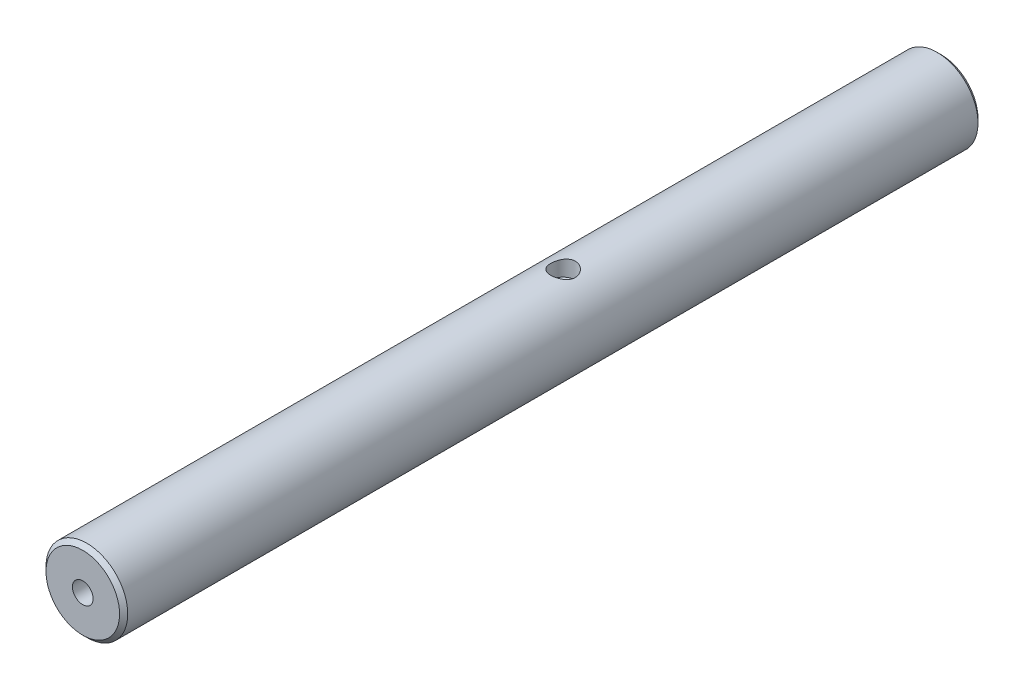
ISO-10303-21;
HEADER;
FILE_DESCRIPTION(('STEP AP214'),'2;1');
FILE_NAME('part.step','',(''),(''),'','','');
FILE_SCHEMA(('AUTOMOTIVE_DESIGN { 1 0 10303 214 1 1 1 1 }'));
ENDSEC;
DATA;
#1=APPLICATION_CONTEXT('core data for automotive mechanical design processes');
#2=APPLICATION_PROTOCOL_DEFINITION('international standard','automotive_design',2000,#1);
#3=PRODUCT_CONTEXT('',#1,'mechanical');
#4=PRODUCT('Part','Part','',(#3));
#5=PRODUCT_RELATED_PRODUCT_CATEGORY('part','',(#4));
#6=PRODUCT_DEFINITION_FORMATION('','',#4);
#7=PRODUCT_DEFINITION_CONTEXT('part definition',#1,'design');
#8=PRODUCT_DEFINITION('design','',#6,#7);
#9=PRODUCT_DEFINITION_SHAPE('','',#8);
#10=(LENGTH_UNIT() NAMED_UNIT(*) SI_UNIT(.MILLI.,.METRE.));
#11=(NAMED_UNIT(*) PLANE_ANGLE_UNIT() SI_UNIT($,.RADIAN.));
#12=(NAMED_UNIT(*) SI_UNIT($,.STERADIAN.) SOLID_ANGLE_UNIT());
#13=UNCERTAINTY_MEASURE_WITH_UNIT(LENGTH_MEASURE(1.E-05),#10,'distance_accuracy_value','');
#14=(GEOMETRIC_REPRESENTATION_CONTEXT(3) GLOBAL_UNCERTAINTY_ASSIGNED_CONTEXT((#13)) GLOBAL_UNIT_ASSIGNED_CONTEXT((#10,
#11,#12)) REPRESENTATION_CONTEXT('',''));
#15=CARTESIAN_POINT('',(0.,0.,0.));
#16=DIRECTION('',(0.,0.,1.));
#17=DIRECTION('',(1.,0.,0.));
#18=AXIS2_PLACEMENT_3D('',#15,#16,#17);
#19=CARTESIAN_POINT('',(0.,0.,380.));
#20=DIRECTION('',(0.,0.,1.));
#21=DIRECTION('',(1.,0.,0.));
#22=AXIS2_PLACEMENT_3D('',#19,#20,#21);
#23=CONICAL_SURFACE('',#22,5.05300000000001,1.02974425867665);
#24=CARTESIAN_POINT('',(0.,0.,380.));
#25=DIRECTION('',(0.,0.,1.));
#26=DIRECTION('',(1.,0.,0.));
#27=AXIS2_PLACEMENT_3D('',#24,#25,#26);
#28=CIRCLE('',#27,5.053);
#29=CARTESIAN_POINT('',(5.053,0.,380.));
#30=VERTEX_POINT('',#29);
#31=EDGE_CURVE('E75',#30,#30,#28,.T.);
#32=ORIENTED_EDGE('',*,*,#31,.T.);
#33=EDGE_LOOP('',(#32));
#34=FACE_BOUND('',#33,.T.);
#35=CARTESIAN_POINT('',(0.,0.,376.963851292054));
#36=VERTEX_POINT('',#35);
#37=VERTEX_LOOP('',#36);
#38=FACE_BOUND('',#37,.T.);
#39=ADVANCED_FACE('F16',(#34,#38),#23,.F.);
#40=CARTESIAN_POINT('',(0.,12.,185.));
#41=DIRECTION('',(0.,1.,0.));
#42=DIRECTION('',(0.,0.,1.));
#43=AXIS2_PLACEMENT_3D('',#40,#41,#42);
#44=CONICAL_SURFACE('',#43,6.,1.02974425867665);
#45=CARTESIAN_POINT('',(0.,12.,185.));
#46=DIRECTION('',(0.,1.,0.));
#47=DIRECTION('',(0.,0.,1.));
#48=AXIS2_PLACEMENT_3D('',#45,#46,#47);
#49=CIRCLE('',#48,6.);
#50=CARTESIAN_POINT('',(0.,12.,191.));
#51=VERTEX_POINT('',#50);
#52=EDGE_CURVE('E71',#51,#51,#49,.T.);
#53=ORIENTED_EDGE('',*,*,#52,.T.);
#54=EDGE_LOOP('',(#53));
#55=FACE_BOUND('',#54,.T.);
#56=CARTESIAN_POINT('',(0.,8.39483628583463,185.));
#57=VERTEX_POINT('',#56);
#58=VERTEX_LOOP('',#57);
#59=FACE_BOUND('',#58,.T.);
#60=ADVANCED_FACE('F34',(#55,#59),#44,.F.);
#61=CARTESIAN_POINT('',(0.,0.,420.));
#62=DIRECTION('',(0.,0.,-1.));
#63=DIRECTION('',(0.,1.,0.));
#64=AXIS2_PLACEMENT_3D('',#61,#62,#63);
#65=CYLINDRICAL_SURFACE('',#64,5.053);
#66=ORIENTED_EDGE('',*,*,#31,.F.);
#67=EDGE_LOOP('',(#66));
#68=FACE_BOUND('',#67,.T.);
#69=CARTESIAN_POINT('',(0.,0.,420.));
#70=DIRECTION('',(0.,0.,-1.));
#71=DIRECTION('',(0.,1.,0.));
#72=AXIS2_PLACEMENT_3D('',#69,#70,#71);
#73=CIRCLE('',#72,5.053);
#74=CARTESIAN_POINT('',(0.,5.053,420.));
#75=VERTEX_POINT('',#74);
#76=EDGE_CURVE('E21',#75,#75,#73,.F.);
#77=ORIENTED_EDGE('',*,*,#76,.T.);
#78=EDGE_LOOP('',(#77));
#79=FACE_BOUND('',#78,.T.);
#80=ADVANCED_FACE('F40',(#68,#79),#65,.F.);
#81=CARTESIAN_POINT('',(0.,0.,0.));
#82=DIRECTION('',(0.,0.,-1.));
#83=DIRECTION('',(-1.,0.,0.));
#84=AXIS2_PLACEMENT_3D('',#81,#82,#83);
#85=PLANE('',#84);
#86=CARTESIAN_POINT('',(0.,0.,-8.97448781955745E-10));
#87=DIRECTION('',(0.,0.,1.));
#88=DIRECTION('',(1.,0.,0.));
#89=AXIS2_PLACEMENT_3D('',#86,#87,#88);
#90=CIRCLE('',#89,18.0000000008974);
#91=CARTESIAN_POINT('',(18.0000000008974,0.,-8.97448781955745E-10));
#92=VERTEX_POINT('',#91);
#93=EDGE_CURVE('E65',#92,#92,#90,.T.);
#94=ORIENTED_EDGE('',*,*,#93,.F.);
#95=EDGE_LOOP('',(#94));
#96=FACE_BOUND('',#95,.T.);
#97=ADVANCED_FACE('F91',(#96),#85,.T.);
#98=CARTESIAN_POINT('',(0.,20.0028866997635,185.));
#99=DIRECTION('',(0.,-1.,0.));
#100=DIRECTION('',(0.,0.,-1.));
#101=AXIS2_PLACEMENT_3D('',#98,#99,#100);
#102=CYLINDRICAL_SURFACE('',#101,6.);
#103=ORIENTED_EDGE('',*,*,#52,.F.);
#104=EDGE_LOOP('',(#103));
#105=FACE_BOUND('',#104,.T.);
#106=CARTESIAN_POINT('',(6.,19.0787840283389,185.));
#107=CARTESIAN_POINT('',(6.00000311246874,19.0787815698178,185.164358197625));
#108=CARTESIAN_POINT('',(5.99324384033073,19.0809122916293,185.328679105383));
#109=CARTESIAN_POINT('',(5.96627542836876,19.0893627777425,185.656155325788));
#110=CARTESIAN_POINT('',(5.94606367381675,19.095683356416,185.819310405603));
#111=CARTESIAN_POINT('',(5.89235350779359,19.1123246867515,186.14330994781));
#112=CARTESIAN_POINT('',(5.85884674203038,19.1226479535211,186.304152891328));
#113=CARTESIAN_POINT('',(5.77883325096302,19.1469797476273,186.622347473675));
#114=CARTESIAN_POINT('',(5.73232159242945,19.1609896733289,186.779697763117));
#115=CARTESIAN_POINT('',(5.62681244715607,19.1922380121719,187.089420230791));
#116=CARTESIAN_POINT('',(5.56784405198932,19.2094688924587,187.241803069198));
#117=CARTESIAN_POINT('',(5.43782627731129,19.2466778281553,187.541001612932));
#118=CARTESIAN_POINT('',(5.36677235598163,19.2666569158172,187.687815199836));
#119=CARTESIAN_POINT('',(5.13631085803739,19.3298668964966,188.118348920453));
#120=CARTESIAN_POINT('',(4.95949232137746,19.376405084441,188.392486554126));
#121=CARTESIAN_POINT('',(4.55855210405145,19.4746805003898,188.915517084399));
#122=CARTESIAN_POINT('',(4.3332205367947,19.5265284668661,189.163461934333));
#123=CARTESIAN_POINT('',(3.96675985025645,19.6030731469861,189.504753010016));
#124=CARTESIAN_POINT('',(3.83976545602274,19.6284004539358,189.613476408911));
#125=CARTESIAN_POINT('',(3.57703626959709,19.6779737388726,189.820030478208));
#126=CARTESIAN_POINT('',(3.44130477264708,19.7022201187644,189.917865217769));
#127=CARTESIAN_POINT('',(3.15893048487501,19.7494833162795,190.103956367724));
#128=CARTESIAN_POINT('',(3.0121157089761,19.7724624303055,190.191961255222));
#129=CARTESIAN_POINT('',(2.71127488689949,19.8159550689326,190.355208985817));
#130=CARTESIAN_POINT('',(2.5572516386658,19.8364695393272,190.430456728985));
#131=CARTESIAN_POINT('',(2.24313420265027,19.8744394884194,190.567556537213));
#132=CARTESIAN_POINT('',(2.08304511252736,19.8918974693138,190.629419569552));
#133=CARTESIAN_POINT('',(1.75789816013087,19.9232649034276,190.739272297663));
#134=CARTESIAN_POINT('',(1.59284154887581,19.9371752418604,190.787265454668));
#135=CARTESIAN_POINT('',(1.19319873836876,19.9657351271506,190.88503186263));
#136=CARTESIAN_POINT('',(0.956797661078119,19.9785237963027,190.928081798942));
#137=CARTESIAN_POINT('',(0.48023785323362,19.995654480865,190.985562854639));
#138=CARTESIAN_POINT('',(0.240079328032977,19.9999969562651,190.999995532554));
#139=CARTESIAN_POINT('',(-0.164545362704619,20.0000020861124,191.000003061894));
#140=CARTESIAN_POINT('',(-0.329053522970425,19.9979657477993,190.993228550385));
#141=CARTESIAN_POINT('',(-0.656909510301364,19.9898808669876,190.966197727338));
#142=CARTESIAN_POINT('',(-0.820257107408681,19.983831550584,190.945938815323));
#143=CARTESIAN_POINT('',(-1.14464625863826,19.9678787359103,190.892099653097));
#144=CARTESIAN_POINT('',(-1.305686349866,19.9579728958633,190.858511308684));
#145=CARTESIAN_POINT('',(-1.62427996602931,19.9345739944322,190.778296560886));
#146=CARTESIAN_POINT('',(-1.78183215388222,19.921079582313,190.731665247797));
#147=CARTESIAN_POINT('',(-2.09198432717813,19.8908978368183,190.625867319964));
#148=CARTESIAN_POINT('',(-2.24459410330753,19.8742173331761,190.566727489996));
#149=CARTESIAN_POINT('',(-2.54422846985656,19.838087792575,190.436325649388));
#150=CARTESIAN_POINT('',(-2.69125093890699,19.81863771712,190.36505908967));
#151=CARTESIAN_POINT('',(-3.12235749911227,19.7568940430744,190.133909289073));
#152=CARTESIAN_POINT('',(-3.39681281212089,19.7111730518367,189.956561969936));
#153=CARTESIAN_POINT('',(-3.91953855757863,19.6140231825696,189.555066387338));
#154=CARTESIAN_POINT('',(-4.16694953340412,19.5624773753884,189.329827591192));
#155=CARTESIAN_POINT('',(-4.5074562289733,19.485801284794,188.963677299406));
#156=CARTESIAN_POINT('',(-4.61592229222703,19.4603320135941,188.836812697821));
#157=CARTESIAN_POINT('',(-4.82197820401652,19.4103000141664,188.574397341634));
#158=CARTESIAN_POINT('',(-4.91957207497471,19.3857369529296,188.438849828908));
#159=CARTESIAN_POINT('',(-5.10537240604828,19.3376473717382,188.156641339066));
#160=CARTESIAN_POINT('',(-5.19330666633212,19.3141584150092,188.009794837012));
#161=CARTESIAN_POINT('',(-5.35641042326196,19.2695618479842,187.708899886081));
#162=CARTESIAN_POINT('',(-5.43158482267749,19.2484533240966,187.554854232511));
#163=CARTESIAN_POINT('',(-5.56853860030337,19.2092804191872,187.240694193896));
#164=CARTESIAN_POINT('',(-5.63032930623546,19.1912134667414,187.08058507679));
#165=CARTESIAN_POINT('',(-5.74004058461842,19.1586846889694,186.755387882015));
#166=CARTESIAN_POINT('',(-5.78796468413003,19.1442219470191,186.59030108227));
#167=CARTESIAN_POINT('',(-5.88544736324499,19.1145256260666,186.191052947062));
#168=CARTESIAN_POINT('',(-5.92834031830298,19.1011952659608,185.955085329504));
#169=CARTESIAN_POINT('',(-5.98561344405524,19.0833265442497,185.479385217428));
#170=CARTESIAN_POINT('',(-5.99999546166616,19.0787876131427,185.239652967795));
#171=CARTESIAN_POINT('',(-6.00000311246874,19.0787815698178,184.835641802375));
#172=CARTESIAN_POINT('',(-5.99324384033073,19.0809122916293,184.671320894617));
#173=CARTESIAN_POINT('',(-5.96627542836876,19.0893627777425,184.343844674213));
#174=CARTESIAN_POINT('',(-5.94606367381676,19.095683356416,184.180689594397));
#175=CARTESIAN_POINT('',(-5.89235350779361,19.1123246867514,183.85669005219));
#176=CARTESIAN_POINT('',(-5.85884674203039,19.1226479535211,183.695847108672));
#177=CARTESIAN_POINT('',(-5.77883325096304,19.1469797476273,183.377652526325));
#178=CARTESIAN_POINT('',(-5.73232159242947,19.1609896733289,183.220302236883));
#179=CARTESIAN_POINT('',(-5.62681244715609,19.1922380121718,182.91057976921));
#180=CARTESIAN_POINT('',(-5.56784405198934,19.2094688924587,182.758196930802));
#181=CARTESIAN_POINT('',(-5.43782627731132,19.2466778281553,182.458998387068));
#182=CARTESIAN_POINT('',(-5.36677235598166,19.2666569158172,182.312184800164));
#183=CARTESIAN_POINT('',(-5.13631085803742,19.3298668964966,181.881651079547));
#184=CARTESIAN_POINT('',(-4.95949232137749,19.376405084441,181.607513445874));
#185=CARTESIAN_POINT('',(-4.5585521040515,19.4746805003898,181.084482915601));
#186=CARTESIAN_POINT('',(-4.33322053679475,19.5265284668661,180.836538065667));
#187=CARTESIAN_POINT('',(-3.96675985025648,19.6030731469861,180.495246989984));
#188=CARTESIAN_POINT('',(-3.83976545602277,19.6284004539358,180.386523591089));
#189=CARTESIAN_POINT('',(-3.57703626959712,19.6779737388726,180.179969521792));
#190=CARTESIAN_POINT('',(-3.44130477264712,19.7022201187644,180.082134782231));
#191=CARTESIAN_POINT('',(-3.15893048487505,19.7494833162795,179.896043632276));
#192=CARTESIAN_POINT('',(-3.01211570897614,19.7724624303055,179.808038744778));
#193=CARTESIAN_POINT('',(-2.71127488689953,19.8159550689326,179.644791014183));
#194=CARTESIAN_POINT('',(-2.55725163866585,19.8364695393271,179.569543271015));
#195=CARTESIAN_POINT('',(-2.24313420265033,19.8744394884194,179.432443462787));
#196=CARTESIAN_POINT('',(-2.08304511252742,19.8918974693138,179.370580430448));
#197=CARTESIAN_POINT('',(-1.75789816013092,19.9232649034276,179.260727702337));
#198=CARTESIAN_POINT('',(-1.59284154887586,19.9371752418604,179.212734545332));
#199=CARTESIAN_POINT('',(-1.19319873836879,19.9657351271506,179.11496813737));
#200=CARTESIAN_POINT('',(-0.956797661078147,19.9785237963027,179.071918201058));
#201=CARTESIAN_POINT('',(-0.480237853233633,19.995654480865,179.014437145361));
#202=CARTESIAN_POINT('',(-0.24007932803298,19.9999969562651,179.000004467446));
#203=CARTESIAN_POINT('',(0.164545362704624,20.0000020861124,178.999996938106));
#204=CARTESIAN_POINT('',(0.329053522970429,19.9979657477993,179.006771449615));
#205=CARTESIAN_POINT('',(0.656909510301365,19.9898808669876,179.033802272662));
#206=CARTESIAN_POINT('',(0.820257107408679,19.983831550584,179.054061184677));
#207=CARTESIAN_POINT('',(1.14464625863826,19.9678787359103,179.107900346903));
#208=CARTESIAN_POINT('',(1.305686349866,19.9579728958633,179.141488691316));
#209=CARTESIAN_POINT('',(1.62427996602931,19.9345739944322,179.221703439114));
#210=CARTESIAN_POINT('',(1.78183215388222,19.921079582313,179.268334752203));
#211=CARTESIAN_POINT('',(2.09198432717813,19.8908978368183,179.374132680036));
#212=CARTESIAN_POINT('',(2.24459410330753,19.8742173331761,179.433272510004));
#213=CARTESIAN_POINT('',(2.54422846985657,19.838087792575,179.563674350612));
#214=CARTESIAN_POINT('',(2.691250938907,19.81863771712,179.63494091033));
#215=CARTESIAN_POINT('',(3.12235749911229,19.7568940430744,179.866090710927));
#216=CARTESIAN_POINT('',(3.3968128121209,19.7111730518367,180.043438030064));
#217=CARTESIAN_POINT('',(3.91953855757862,19.6140231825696,180.444933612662));
#218=CARTESIAN_POINT('',(4.16694953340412,19.5624773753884,180.670172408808));
#219=CARTESIAN_POINT('',(4.5074562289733,19.485801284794,181.036322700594));
#220=CARTESIAN_POINT('',(4.61592229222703,19.4603320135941,181.163187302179));
#221=CARTESIAN_POINT('',(4.82197820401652,19.4103000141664,181.425602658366));
#222=CARTESIAN_POINT('',(4.91957207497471,19.3857369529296,181.561150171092));
#223=CARTESIAN_POINT('',(5.10537240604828,19.3376473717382,181.843358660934));
#224=CARTESIAN_POINT('',(5.19330666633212,19.3141584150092,181.990205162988));
#225=CARTESIAN_POINT('',(5.35641042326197,19.2695618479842,182.291100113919));
#226=CARTESIAN_POINT('',(5.43158482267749,19.2484533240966,182.445145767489));
#227=CARTESIAN_POINT('',(5.56853860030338,19.2092804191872,182.759305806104));
#228=CARTESIAN_POINT('',(5.63032930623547,19.1912134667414,182.91941492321));
#229=CARTESIAN_POINT('',(5.74004058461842,19.1586846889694,183.244612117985));
#230=CARTESIAN_POINT('',(5.78796468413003,19.1442219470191,183.40969891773));
#231=CARTESIAN_POINT('',(5.88544736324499,19.1145256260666,183.808947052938));
#232=CARTESIAN_POINT('',(5.92834031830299,19.1011952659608,184.044914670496));
#233=CARTESIAN_POINT('',(5.98561344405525,19.0833265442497,184.520614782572));
#234=CARTESIAN_POINT('',(5.99999546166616,19.0787876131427,184.760347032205));
#235=CARTESIAN_POINT('',(6.,19.0787840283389,185.));
#236=B_SPLINE_CURVE_WITH_KNOTS('',3,(#106,#107,#108,#109,#110,#111,#112,#113,#114,#115,#116,
#117,#118,#119,#120,#121,#122,#123,#124,#125,#126,#127,#128,#129,#130,#131,#132,#133,#134,#135,
#136,#137,#138,#139,#140,#141,#142,#143,#144,#145,#146,#147,#148,#149,#150,#151,#152,#153,#154,
#155,#156,#157,#158,#159,#160,#161,#162,#163,#164,#165,#166,#167,#168,#169,#170,#171,#172,#173,
#174,#175,#176,#177,#178,#179,#180,#181,#182,#183,#184,#185,#186,#187,#188,#189,#190,#191,#192,
#193,#194,#195,#196,#197,#198,#199,#200,#201,#202,#203,#204,#205,#206,#207,#208,#209,#210,#211,
#212,#213,#214,#215,#216,#217,#218,#219,#220,#221,#222,#223,#224,#225,#226,#227,#228,#229,#230,
#231,#232,#233,#234,#235),.UNSPECIFIED.,.T.,.F.,(4,2,2,2,2,2,2,2,2,2,2,2,2,2,2,2,2,2,2,2,2,2,2,
2,2,2,2,2,2,2,2,2,2,2,2,2,2,2,2,2,2,2,2,2,2,2,2,2,2,2,2,2,2,2,2,2,2,2,2,2,2,2,2,2,4),(0.,
0.492858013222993,0.985811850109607,1.47907594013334,1.97252739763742,2.46483893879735,
2.95733590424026,3.94130797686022,4.95346524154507,5.46023989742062,5.96682452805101,
6.48431412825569,7.00160450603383,7.51846940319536,8.03520520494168,8.75516758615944,
9.47509075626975,9.96851107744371,10.4620265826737,10.9558422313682,11.4498440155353,
11.9427985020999,12.4359383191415,13.4211727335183,14.4318554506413,14.9379087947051,
15.4437742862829,15.9614442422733,16.4789148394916,16.9959457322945,17.5128449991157,
18.2315346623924,18.9501777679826,19.4430357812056,19.9359896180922,20.4292537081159,
20.92270516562,21.4150167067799,21.9075136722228,22.8914857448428,23.9036430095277,
24.4104176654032,24.9170022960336,25.4344918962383,25.9517822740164,26.4686471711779,
26.9853829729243,27.7053453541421,28.4252685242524,28.9186888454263,29.4122043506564,
29.9060199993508,30.400021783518,30.8929762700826,31.3861160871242,32.3713505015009,
33.3820332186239,33.8880865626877,34.3939520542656,34.9116220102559,35.4290926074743,
35.9461235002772,36.4630227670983,37.1817124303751,37.9003555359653),.UNSPECIFIED.);
#237=CARTESIAN_POINT('',(6.,19.0787840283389,185.));
#238=VERTEX_POINT('',#237);
#239=EDGE_CURVE('E59',#238,#238,#236,.T.);
#240=ORIENTED_EDGE('',*,*,#239,.F.);
#241=EDGE_LOOP('',(#240));
#242=FACE_BOUND('',#241,.T.);
#243=ADVANCED_FACE('F18',(#105,#242),#102,.F.);
#244=CARTESIAN_POINT('',(0.,0.,420.));
#245=DIRECTION('',(0.,0.,-1.));
#246=DIRECTION('',(-1.,0.,0.));
#247=AXIS2_PLACEMENT_3D('',#244,#245,#246);
#248=PLANE('',#247);
#249=ORIENTED_EDGE('',*,*,#76,.F.);
#250=EDGE_LOOP('',(#249));
#251=FACE_BOUND('',#250,.T.);
#252=CARTESIAN_POINT('',(0.,0.,420.000000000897));
#253=DIRECTION('',(0.,0.,-1.));
#254=DIRECTION('',(0.,1.,0.));
#255=AXIS2_PLACEMENT_3D('',#252,#253,#254);
#256=CIRCLE('',#255,18.0000000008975);
#257=CARTESIAN_POINT('',(0.,18.0000000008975,420.000000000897));
#258=VERTEX_POINT('',#257);
#259=EDGE_CURVE('E64',#258,#258,#256,.T.);
#260=ORIENTED_EDGE('',*,*,#259,.F.);
#261=EDGE_LOOP('',(#260));
#262=FACE_BOUND('',#261,.T.);
#263=ADVANCED_FACE('F84',(#251,#262),#248,.F.);
#264=CARTESIAN_POINT('',(0.,0.,2.00000000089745));
#265=DIRECTION('',(0.,0.,1.));
#266=DIRECTION('',(1.,0.,0.));
#267=AXIS2_PLACEMENT_3D('',#264,#265,#266);
#268=CONICAL_SURFACE('',#267,19.9999999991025,0.7853981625);
#269=ORIENTED_EDGE('',*,*,#93,.T.);
#270=EDGE_LOOP('',(#269));
#271=FACE_BOUND('',#270,.T.);
#272=CARTESIAN_POINT('',(0.,0.,2.));
#273=DIRECTION('',(0.,0.,1.));
#274=DIRECTION('',(1.,0.,0.));
#275=AXIS2_PLACEMENT_3D('',#272,#273,#274);
#276=CIRCLE('',#275,20.);
#277=CARTESIAN_POINT('',(20.,0.,2.));
#278=VERTEX_POINT('',#277);
#279=EDGE_CURVE('E27',#278,#278,#276,.T.);
#280=ORIENTED_EDGE('',*,*,#279,.F.);
#281=EDGE_LOOP('',(#280));
#282=FACE_BOUND('',#281,.T.);
#283=ADVANCED_FACE('F51',(#271,#282),#268,.T.);
#284=CARTESIAN_POINT('',(0.,0.,417.999999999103));
#285=DIRECTION('',(0.,0.,-1.));
#286=DIRECTION('',(0.,1.,0.));
#287=AXIS2_PLACEMENT_3D('',#284,#285,#286);
#288=CONICAL_SURFACE('',#287,19.9999999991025,0.785398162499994);
#289=CARTESIAN_POINT('',(0.,0.,418.));
#290=DIRECTION('',(0.,0.,1.));
#291=DIRECTION('',(1.,0.,0.));
#292=AXIS2_PLACEMENT_3D('',#289,#290,#291);
#293=CIRCLE('',#292,20.);
#294=CARTESIAN_POINT('',(20.,0.,418.));
#295=VERTEX_POINT('',#294);
#296=EDGE_CURVE('E10',#295,#295,#293,.F.);
#297=ORIENTED_EDGE('',*,*,#296,.F.);
#298=EDGE_LOOP('',(#297));
#299=FACE_BOUND('',#298,.T.);
#300=ORIENTED_EDGE('',*,*,#259,.T.);
#301=EDGE_LOOP('',(#300));
#302=FACE_BOUND('',#301,.T.);
#303=ADVANCED_FACE('F47',(#299,#302),#288,.T.);
#304=CARTESIAN_POINT('',(0.,0.,0.));
#305=DIRECTION('',(0.,0.,1.));
#306=DIRECTION('',(1.,0.,0.));
#307=AXIS2_PLACEMENT_3D('',#304,#305,#306);
#308=CYLINDRICAL_SURFACE('',#307,20.);
#309=ORIENTED_EDGE('',*,*,#279,.T.);
#310=EDGE_LOOP('',(#309));
#311=FACE_BOUND('',#310,.T.);
#312=ORIENTED_EDGE('',*,*,#296,.T.);
#313=EDGE_LOOP('',(#312));
#314=FACE_BOUND('',#313,.T.);
#315=ORIENTED_EDGE('',*,*,#239,.T.);
#316=EDGE_LOOP('',(#315));
#317=FACE_BOUND('',#316,.T.);
#318=ADVANCED_FACE('F45',(#311,#314,#317),#308,.T.);
#319=CLOSED_SHELL('',(#39,#60,#80,#97,#243,#263,#283,#303,#318));
#320=MANIFOLD_SOLID_BREP('B1',#319);
#321=ADVANCED_BREP_SHAPE_REPRESENTATION('',(#18,#320),#14);
#322=SHAPE_DEFINITION_REPRESENTATION(#9,#321);
ENDSEC;
END-ISO-10303-21;
